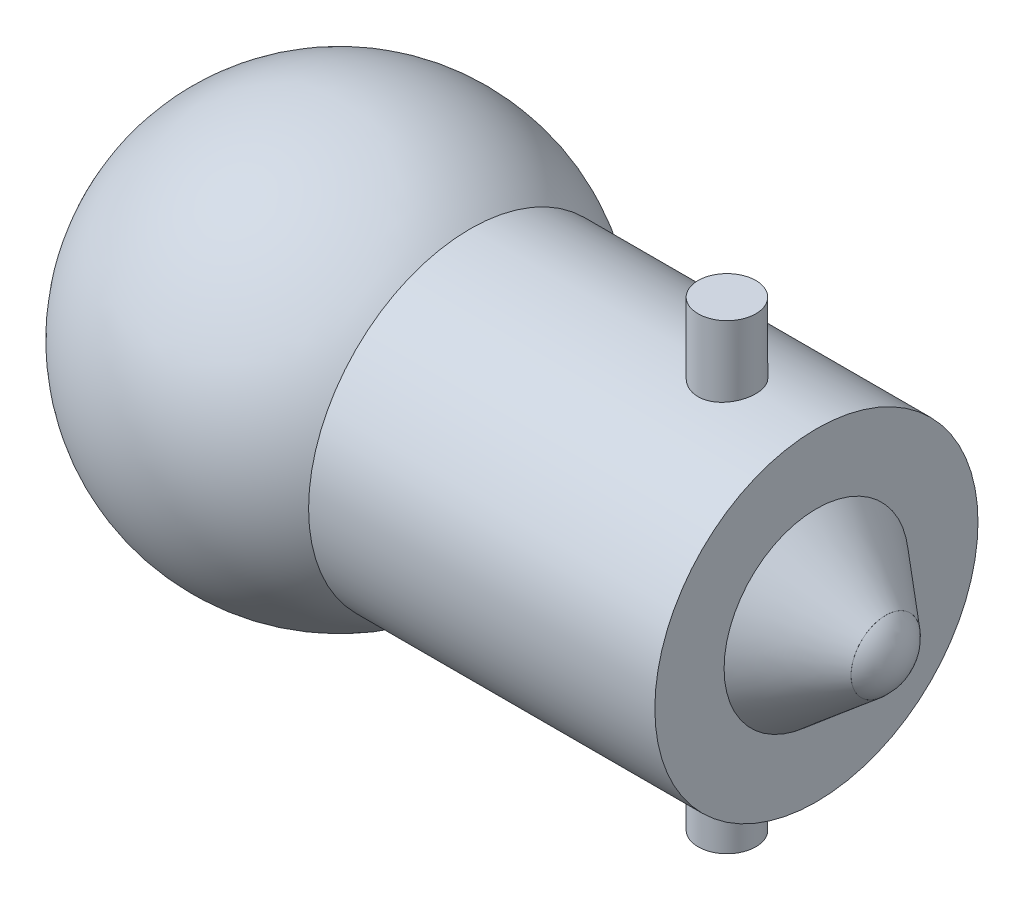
ISO-10303-21;
HEADER;
FILE_DESCRIPTION(('STEP AP214'),'2;1');
FILE_NAME('part.step','',(''),(''),'','','');
FILE_SCHEMA(('AUTOMOTIVE_DESIGN { 1 0 10303 214 1 1 1 1 }'));
ENDSEC;
DATA;
#1=APPLICATION_CONTEXT('core data for automotive mechanical design processes');
#2=APPLICATION_PROTOCOL_DEFINITION('international standard','automotive_design',2000,#1);
#3=PRODUCT_CONTEXT('',#1,'mechanical');
#4=PRODUCT('Part','Part','',(#3));
#5=PRODUCT_RELATED_PRODUCT_CATEGORY('part','',(#4));
#6=PRODUCT_DEFINITION_FORMATION('','',#4);
#7=PRODUCT_DEFINITION_CONTEXT('part definition',#1,'design');
#8=PRODUCT_DEFINITION('design','',#6,#7);
#9=PRODUCT_DEFINITION_SHAPE('','',#8);
#10=(LENGTH_UNIT() NAMED_UNIT(*) SI_UNIT(.MILLI.,.METRE.));
#11=(NAMED_UNIT(*) PLANE_ANGLE_UNIT() SI_UNIT($,.RADIAN.));
#12=(NAMED_UNIT(*) SI_UNIT($,.STERADIAN.) SOLID_ANGLE_UNIT());
#13=UNCERTAINTY_MEASURE_WITH_UNIT(LENGTH_MEASURE(1.E-05),#10,'distance_accuracy_value','');
#14=(GEOMETRIC_REPRESENTATION_CONTEXT(3) GLOBAL_UNCERTAINTY_ASSIGNED_CONTEXT((#13)) GLOBAL_UNIT_ASSIGNED_CONTEXT((#10,
#11,#12)) REPRESENTATION_CONTEXT('',''));
#15=CARTESIAN_POINT('',(0.,0.,0.));
#16=DIRECTION('',(0.,0.,1.));
#17=DIRECTION('',(1.,0.,0.));
#18=AXIS2_PLACEMENT_3D('',#15,#16,#17);
#19=CARTESIAN_POINT('',(-15.,0.,0.));
#20=DIRECTION('',(1.,0.,0.));
#21=DIRECTION('',(0.,0.,-1.));
#22=AXIS2_PLACEMENT_3D('',#19,#20,#21);
#23=CYLINDRICAL_SURFACE('',#22,7.);
#24=CARTESIAN_POINT('',(-3.875,-6.88748865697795,-1.25));
#25=CARTESIAN_POINT('',(-3.94460981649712,-6.88748996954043,-1.24999727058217));
#26=CARTESIAN_POINT('',(-4.01425577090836,-6.88855539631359,-1.24416565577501));
#27=CARTESIAN_POINT('',(-4.15158813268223,-6.89269731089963,-1.22100652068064));
#28=CARTESIAN_POINT('',(-4.21927275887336,-6.89577557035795,-1.20366887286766));
#29=CARTESIAN_POINT('',(-4.35067533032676,-6.90358364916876,-1.15804345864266));
#30=CARTESIAN_POINT('',(-4.41439674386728,-6.90831199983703,-1.12976542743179));
#31=CARTESIAN_POINT('',(-4.53618554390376,-6.91888575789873,-1.06308709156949));
#32=CARTESIAN_POINT('',(-4.59425345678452,-6.92473106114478,-1.024687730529));
#33=CARTESIAN_POINT('',(-4.70374846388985,-6.93695388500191,-0.938394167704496));
#34=CARTESIAN_POINT('',(-4.75510240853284,-6.94333619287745,-0.890407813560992));
#35=CARTESIAN_POINT('',(-4.84907526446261,-6.95587151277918,-0.786501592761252));
#36=CARTESIAN_POINT('',(-4.89169362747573,-6.96202451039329,-0.730581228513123));
#37=CARTESIAN_POINT('',(-4.96726335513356,-6.97345895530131,-0.611916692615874));
#38=CARTESIAN_POINT('',(-5.00014613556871,-6.97873410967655,-0.549128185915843));
#39=CARTESIAN_POINT('',(-5.05486987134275,-6.98776505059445,-0.41880838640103));
#40=CARTESIAN_POINT('',(-5.07671165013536,-6.99152095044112,-0.351277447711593));
#41=CARTESIAN_POINT('',(-5.10850824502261,-6.99705638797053,-0.214146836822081));
#42=CARTESIAN_POINT('',(-5.11858620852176,-6.99885638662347,-0.144576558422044));
#43=CARTESIAN_POINT('',(-5.12695246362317,-7.00034763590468,-0.00471086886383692));
#44=CARTESIAN_POINT('',(-5.12524166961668,-7.00003905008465,0.0655844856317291));
#45=CARTESIAN_POINT('',(-5.11017412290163,-6.99736398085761,0.204061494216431));
#46=CARTESIAN_POINT('',(-5.09694993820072,-6.99502092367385,0.272258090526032));
#47=CARTESIAN_POINT('',(-5.0594402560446,-6.98856637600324,0.405448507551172));
#48=CARTESIAN_POINT('',(-5.03515438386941,-6.98445482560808,0.470442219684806));
#49=CARTESIAN_POINT('',(-4.97608200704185,-6.97488577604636,0.59577075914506));
#50=CARTESIAN_POINT('',(-4.94124178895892,-6.96942141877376,0.656079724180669));
#51=CARTESIAN_POINT('',(-4.86208918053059,-6.95775231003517,0.770045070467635));
#52=CARTESIAN_POINT('',(-4.8177759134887,-6.95154749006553,0.823700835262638));
#53=CARTESIAN_POINT('',(-4.7202024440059,-6.93898404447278,0.923621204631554));
#54=CARTESIAN_POINT('',(-4.66682630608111,-6.93262448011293,0.969772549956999));
#55=CARTESIAN_POINT('',(-4.55303039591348,-6.92055128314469,1.05248393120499));
#56=CARTESIAN_POINT('',(-4.49261053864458,-6.9148376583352,1.08904385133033));
#57=CARTESIAN_POINT('',(-4.36630047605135,-6.9047022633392,1.15156239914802));
#58=CARTESIAN_POINT('',(-4.30040258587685,-6.90028234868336,1.17750582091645));
#59=CARTESIAN_POINT('',(-4.16508709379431,-6.89326416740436,1.21792201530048));
#60=CARTESIAN_POINT('',(-4.09566985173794,-6.89066571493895,1.23239595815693));
#61=CARTESIAN_POINT('',(-3.95630395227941,-6.88762108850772,1.24929958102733));
#62=CARTESIAN_POINT('',(-3.88637557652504,-6.88714593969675,1.25189141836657));
#63=CARTESIAN_POINT('',(-3.74708483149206,-6.88832434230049,1.24539080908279));
#64=CARTESIAN_POINT('',(-3.677722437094,-6.8899777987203,1.23629888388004));
#65=CARTESIAN_POINT('',(-3.54205770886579,-6.89520021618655,1.20682762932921));
#66=CARTESIAN_POINT('',(-3.47573654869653,-6.89875493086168,1.18653221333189));
#67=CARTESIAN_POINT('',(-3.34743634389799,-6.90736720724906,1.13531866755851));
#68=CARTESIAN_POINT('',(-3.28545759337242,-6.91242487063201,1.10439981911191));
#69=CARTESIAN_POINT('',(-3.16688393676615,-6.92353975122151,1.03243967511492));
#70=CARTESIAN_POINT('',(-3.11035254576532,-6.92960692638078,0.991295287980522));
#71=CARTESIAN_POINT('',(-3.00493787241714,-6.94202871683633,0.900192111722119));
#72=CARTESIAN_POINT('',(-2.95605521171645,-6.948383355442,0.850232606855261));
#73=CARTESIAN_POINT('',(-2.86672584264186,-6.96075653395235,0.742195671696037));
#74=CARTESIAN_POINT('',(-2.82638779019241,-6.96677010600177,0.684027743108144));
#75=CARTESIAN_POINT('',(-2.75605696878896,-6.97770176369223,0.561646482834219));
#76=CARTESIAN_POINT('',(-2.72606382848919,-6.98261988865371,0.497433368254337));
#77=CARTESIAN_POINT('',(-2.6774397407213,-6.99078504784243,0.365094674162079));
#78=CARTESIAN_POINT('',(-2.65875389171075,-6.99404014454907,0.296989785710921));
#79=CARTESIAN_POINT('',(-2.63309885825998,-6.99854674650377,0.158545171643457));
#80=CARTESIAN_POINT('',(-2.62612856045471,-6.9997984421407,0.0882056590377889));
#81=CARTESIAN_POINT('',(-2.62413828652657,-7.00015390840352,-0.0516665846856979));
#82=CARTESIAN_POINT('',(-2.62895367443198,-6.99928727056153,-0.121196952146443));
#83=CARTESIAN_POINT('',(-2.65003948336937,-6.99556445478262,-0.258441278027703));
#84=CARTESIAN_POINT('',(-2.66630981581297,-6.99270829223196,-0.326155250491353));
#85=CARTESIAN_POINT('',(-2.70977696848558,-6.98532676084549,-0.457768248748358));
#86=CARTESIAN_POINT('',(-2.73695781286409,-6.98080383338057,-0.521672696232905));
#87=CARTESIAN_POINT('',(-2.80145534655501,-6.97058019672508,-0.644038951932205));
#88=CARTESIAN_POINT('',(-2.83877262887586,-6.96487941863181,-0.702500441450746));
#89=CARTESIAN_POINT('',(-2.92305799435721,-6.952836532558,-0.813145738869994));
#90=CARTESIAN_POINT('',(-2.97014575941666,-6.94648702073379,-0.865237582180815));
#91=CARTESIAN_POINT('',(-3.07238568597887,-6.9339109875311,-0.960837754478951));
#92=CARTESIAN_POINT('',(-3.12753973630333,-6.92768449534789,-1.0043440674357));
#93=CARTESIAN_POINT('',(-3.24489058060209,-6.91600352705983,-1.08187311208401));
#94=CARTESIAN_POINT('',(-3.30714182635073,-6.9105558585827,-1.1158144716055));
#95=CARTESIAN_POINT('',(-3.43653753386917,-6.90113054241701,-1.17270443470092));
#96=CARTESIAN_POINT('',(-3.50367718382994,-6.89715147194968,-1.19566368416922));
#97=CARTESIAN_POINT('',(-3.62170336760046,-6.89196709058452,-1.22512899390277));
#98=CARTESIAN_POINT('',(-3.67188793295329,-6.89029736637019,-1.23444009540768));
#99=CARTESIAN_POINT('',(-3.77304188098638,-6.88805768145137,-1.24687652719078));
#100=CARTESIAN_POINT('',(-3.82401124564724,-6.88748769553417,-1.25000199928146));
#101=CARTESIAN_POINT('',(-3.875,-6.88748865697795,-1.25));
#102=B_SPLINE_CURVE_WITH_KNOTS('',3,(#24,#25,#26,#27,#28,#29,#30,#31,#32,#33,#34,#35,#36,#37,
#38,#39,#40,#41,#42,#43,#44,#45,#46,#47,#48,#49,#50,#51,#52,#53,#54,#55,#56,#57,#58,#59,#60,#61,
#62,#63,#64,#65,#66,#67,#68,#69,#70,#71,#72,#73,#74,#75,#76,#77,#78,#79,#80,#81,#82,#83,#84,#85,
#86,#87,#88,#89,#90,#91,#92,#93,#94,#95,#96,#97,#98,#99,#100,#101),.UNSPECIFIED.,.T.,.F.,(4,2,2,
2,2,2,2,2,2,2,2,2,2,2,2,2,2,2,2,2,2,2,2,2,2,2,2,2,2,2,2,2,2,2,2,2,2,2,4),(0.,0.208642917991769,
0.417469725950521,0.626111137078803,0.834733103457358,1.04546625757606,1.25621263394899,
1.46841013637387,1.68059181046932,1.89053179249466,2.10045549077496,2.30799357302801,
2.51553868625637,2.72415831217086,2.93279725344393,3.14433992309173,3.35588514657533,
3.56773231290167,3.77955786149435,3.98848380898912,4.19740043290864,4.40477310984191,
4.61215981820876,4.82172878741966,5.03131478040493,5.24342420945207,5.45552602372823,
5.66658955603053,5.87763302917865,6.08574527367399,6.29385590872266,6.50166292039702,
6.70948209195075,6.9200155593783,7.1305984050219,7.34292209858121,7.55503954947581,
7.70787268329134,7.86070231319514),.UNSPECIFIED.);
#103=CARTESIAN_POINT('',(-3.875,-6.88748865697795,-1.25));
#104=VERTEX_POINT('',#103);
#105=EDGE_CURVE('E62',#104,#104,#102,.T.);
#106=ORIENTED_EDGE('',*,*,#105,.T.);
#107=EDGE_LOOP('',(#106));
#108=FACE_BOUND('',#107,.T.);
#109=CARTESIAN_POINT('',(-15.,0.,0.));
#110=DIRECTION('',(1.,0.,0.));
#111=DIRECTION('',(0.,0.,-1.));
#112=AXIS2_PLACEMENT_3D('',#109,#110,#111);
#113=CIRCLE('',#112,7.);
#114=CARTESIAN_POINT('',(-15.,0.,-7.));
#115=VERTEX_POINT('',#114);
#116=EDGE_CURVE('E104',#115,#115,#113,.T.);
#117=ORIENTED_EDGE('',*,*,#116,.T.);
#118=EDGE_LOOP('',(#117));
#119=FACE_BOUND('',#118,.T.);
#120=CARTESIAN_POINT('',(0.,0.,0.));
#121=DIRECTION('',(1.,0.,0.));
#122=DIRECTION('',(0.,0.,-1.));
#123=AXIS2_PLACEMENT_3D('',#120,#121,#122);
#124=CIRCLE('',#123,7.);
#125=CARTESIAN_POINT('',(0.,0.,-7.));
#126=VERTEX_POINT('',#125);
#127=EDGE_CURVE('E59',#126,#126,#124,.T.);
#128=ORIENTED_EDGE('',*,*,#127,.F.);
#129=EDGE_LOOP('',(#128));
#130=FACE_BOUND('',#129,.T.);
#131=CARTESIAN_POINT('',(-3.875,6.88748865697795,-1.25));
#132=CARTESIAN_POINT('',(-3.80539018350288,6.88748996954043,-1.24999727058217));
#133=CARTESIAN_POINT('',(-3.73574422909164,6.88855539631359,-1.24416565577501));
#134=CARTESIAN_POINT('',(-3.59841186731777,6.89269731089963,-1.22100652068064));
#135=CARTESIAN_POINT('',(-3.53072724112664,6.89577557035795,-1.20366887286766));
#136=CARTESIAN_POINT('',(-3.39932466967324,6.90358364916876,-1.15804345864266));
#137=CARTESIAN_POINT('',(-3.33560325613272,6.90831199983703,-1.12976542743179));
#138=CARTESIAN_POINT('',(-3.21381445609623,6.91888575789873,-1.06308709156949));
#139=CARTESIAN_POINT('',(-3.15574654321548,6.92473106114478,-1.024687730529));
#140=CARTESIAN_POINT('',(-3.04625153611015,6.93695388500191,-0.938394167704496));
#141=CARTESIAN_POINT('',(-2.99489759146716,6.94333619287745,-0.890407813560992));
#142=CARTESIAN_POINT('',(-2.90092473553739,6.95587151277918,-0.786501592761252));
#143=CARTESIAN_POINT('',(-2.85830637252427,6.96202451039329,-0.730581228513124));
#144=CARTESIAN_POINT('',(-2.78273664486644,6.97345895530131,-0.611916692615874));
#145=CARTESIAN_POINT('',(-2.74985386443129,6.97873410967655,-0.549128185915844));
#146=CARTESIAN_POINT('',(-2.69513012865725,6.98776505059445,-0.418808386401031));
#147=CARTESIAN_POINT('',(-2.67328834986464,6.99152095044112,-0.351277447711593));
#148=CARTESIAN_POINT('',(-2.64149175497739,6.99705638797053,-0.214146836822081));
#149=CARTESIAN_POINT('',(-2.63141379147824,6.99885638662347,-0.144576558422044));
#150=CARTESIAN_POINT('',(-2.62304753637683,7.00034763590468,-0.00471086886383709));
#151=CARTESIAN_POINT('',(-2.62475833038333,7.00003905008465,0.0655844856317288));
#152=CARTESIAN_POINT('',(-2.63982587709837,6.99736398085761,0.20406149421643));
#153=CARTESIAN_POINT('',(-2.65305006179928,6.99502092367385,0.272258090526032));
#154=CARTESIAN_POINT('',(-2.6905597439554,6.98856637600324,0.405448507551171));
#155=CARTESIAN_POINT('',(-2.71484561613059,6.98445482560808,0.470442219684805));
#156=CARTESIAN_POINT('',(-2.77391799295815,6.97488577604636,0.59577075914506));
#157=CARTESIAN_POINT('',(-2.80875821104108,6.96942141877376,0.656079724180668));
#158=CARTESIAN_POINT('',(-2.88791081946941,6.95775231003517,0.770045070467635));
#159=CARTESIAN_POINT('',(-2.9322240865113,6.95154749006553,0.823700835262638));
#160=CARTESIAN_POINT('',(-3.0297975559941,6.93898404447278,0.923621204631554));
#161=CARTESIAN_POINT('',(-3.08317369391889,6.93262448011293,0.969772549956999));
#162=CARTESIAN_POINT('',(-3.19696960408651,6.92055128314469,1.05248393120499));
#163=CARTESIAN_POINT('',(-3.25738946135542,6.9148376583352,1.08904385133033));
#164=CARTESIAN_POINT('',(-3.38369952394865,6.9047022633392,1.15156239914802));
#165=CARTESIAN_POINT('',(-3.44959741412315,6.90028234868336,1.17750582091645));
#166=CARTESIAN_POINT('',(-3.58491290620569,6.89326416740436,1.21792201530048));
#167=CARTESIAN_POINT('',(-3.65433014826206,6.89066571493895,1.23239595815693));
#168=CARTESIAN_POINT('',(-3.79369604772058,6.88762108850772,1.24929958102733));
#169=CARTESIAN_POINT('',(-3.86362442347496,6.88714593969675,1.25189141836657));
#170=CARTESIAN_POINT('',(-4.00291516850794,6.88832434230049,1.24539080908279));
#171=CARTESIAN_POINT('',(-4.072277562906,6.8899777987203,1.23629888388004));
#172=CARTESIAN_POINT('',(-4.20794229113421,6.89520021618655,1.20682762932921));
#173=CARTESIAN_POINT('',(-4.27426345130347,6.89875493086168,1.18653221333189));
#174=CARTESIAN_POINT('',(-4.40256365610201,6.90736720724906,1.13531866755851));
#175=CARTESIAN_POINT('',(-4.46454240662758,6.91242487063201,1.10439981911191));
#176=CARTESIAN_POINT('',(-4.58311606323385,6.92353975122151,1.03243967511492));
#177=CARTESIAN_POINT('',(-4.63964745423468,6.92960692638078,0.991295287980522));
#178=CARTESIAN_POINT('',(-4.74506212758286,6.94202871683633,0.90019211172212));
#179=CARTESIAN_POINT('',(-4.79394478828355,6.948383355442,0.850232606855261));
#180=CARTESIAN_POINT('',(-4.88327415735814,6.96075653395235,0.742195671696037));
#181=CARTESIAN_POINT('',(-4.92361220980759,6.96677010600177,0.684027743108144));
#182=CARTESIAN_POINT('',(-4.99394303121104,6.97770176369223,0.561646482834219));
#183=CARTESIAN_POINT('',(-5.02393617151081,6.98261988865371,0.497433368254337));
#184=CARTESIAN_POINT('',(-5.0725602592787,6.99078504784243,0.365094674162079));
#185=CARTESIAN_POINT('',(-5.09124610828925,6.99404014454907,0.296989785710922));
#186=CARTESIAN_POINT('',(-5.11690114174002,6.99854674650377,0.158545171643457));
#187=CARTESIAN_POINT('',(-5.12387143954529,6.9997984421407,0.0882056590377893));
#188=CARTESIAN_POINT('',(-5.12586171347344,7.00015390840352,-0.0516665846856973));
#189=CARTESIAN_POINT('',(-5.12104632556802,6.99928727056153,-0.121196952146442));
#190=CARTESIAN_POINT('',(-5.09996051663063,6.99556445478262,-0.258441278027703));
#191=CARTESIAN_POINT('',(-5.08369018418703,6.99270829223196,-0.326155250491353));
#192=CARTESIAN_POINT('',(-5.04022303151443,6.98532676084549,-0.457768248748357));
#193=CARTESIAN_POINT('',(-5.01304218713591,6.98080383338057,-0.521672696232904));
#194=CARTESIAN_POINT('',(-4.94854465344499,6.97058019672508,-0.644038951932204));
#195=CARTESIAN_POINT('',(-4.91122737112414,6.96487941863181,-0.702500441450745));
#196=CARTESIAN_POINT('',(-4.82694200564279,6.952836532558,-0.813145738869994));
#197=CARTESIAN_POINT('',(-4.77985424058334,6.94648702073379,-0.865237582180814));
#198=CARTESIAN_POINT('',(-4.67761431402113,6.9339109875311,-0.960837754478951));
#199=CARTESIAN_POINT('',(-4.62246026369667,6.92768449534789,-1.0043440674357));
#200=CARTESIAN_POINT('',(-4.50510941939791,6.91600352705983,-1.08187311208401));
#201=CARTESIAN_POINT('',(-4.44285817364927,6.9105558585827,-1.1158144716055));
#202=CARTESIAN_POINT('',(-4.31346246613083,6.90113054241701,-1.17270443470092));
#203=CARTESIAN_POINT('',(-4.24632281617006,6.89715147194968,-1.19566368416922));
#204=CARTESIAN_POINT('',(-4.12829663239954,6.89196709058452,-1.22512899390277));
#205=CARTESIAN_POINT('',(-4.07811206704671,6.89029736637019,-1.23444009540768));
#206=CARTESIAN_POINT('',(-3.97695811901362,6.88805768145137,-1.24687652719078));
#207=CARTESIAN_POINT('',(-3.92598875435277,6.88748769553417,-1.25000199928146));
#208=CARTESIAN_POINT('',(-3.875,6.88748865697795,-1.25));
#209=B_SPLINE_CURVE_WITH_KNOTS('',3,(#131,#132,#133,#134,#135,#136,#137,#138,#139,#140,#141,
#142,#143,#144,#145,#146,#147,#148,#149,#150,#151,#152,#153,#154,#155,#156,#157,#158,#159,#160,
#161,#162,#163,#164,#165,#166,#167,#168,#169,#170,#171,#172,#173,#174,#175,#176,#177,#178,#179,
#180,#181,#182,#183,#184,#185,#186,#187,#188,#189,#190,#191,#192,#193,#194,#195,#196,#197,#198,
#199,#200,#201,#202,#203,#204,#205,#206,#207,#208),.UNSPECIFIED.,.T.,.F.,(4,2,2,2,2,2,2,2,2,2,2,
2,2,2,2,2,2,2,2,2,2,2,2,2,2,2,2,2,2,2,2,2,2,2,2,2,2,2,4),(0.,0.208642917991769,
0.417469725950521,0.626111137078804,0.834733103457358,1.04546625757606,1.25621263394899,
1.46841013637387,1.68059181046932,1.89053179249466,2.10045549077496,2.30799357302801,
2.51553868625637,2.72415831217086,2.93279725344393,3.14433992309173,3.35588514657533,
3.56773231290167,3.77955786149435,3.98848380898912,4.19740043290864,4.40477310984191,
4.61215981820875,4.82172878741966,5.03131478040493,5.24342420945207,5.45552602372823,
5.66658955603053,5.87763302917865,6.08574527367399,6.29385590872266,6.50166292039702,
6.70948209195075,6.9200155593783,7.1305984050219,7.34292209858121,7.55503954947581,
7.70787268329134,7.86070231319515),.UNSPECIFIED.);
#210=CARTESIAN_POINT('',(-3.875,6.88748865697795,-1.25));
#211=VERTEX_POINT('',#210);
#212=EDGE_CURVE('E47',#211,#211,#209,.T.);
#213=ORIENTED_EDGE('',*,*,#212,.T.);
#214=EDGE_LOOP('',(#213));
#215=FACE_BOUND('',#214,.T.);
#216=ADVANCED_FACE('F43',(#108,#119,#130,#215),#23,.T.);
#217=CARTESIAN_POINT('',(0.,0.,0.));
#218=DIRECTION('',(1.,0.,0.));
#219=DIRECTION('',(0.,0.,-1.));
#220=AXIS2_PLACEMENT_3D('',#217,#218,#219);
#221=PLANE('',#220);
#222=CARTESIAN_POINT('',(0.,0.,0.));
#223=DIRECTION('',(1.,0.,0.));
#224=DIRECTION('',(0.,0.,-1.));
#225=AXIS2_PLACEMENT_3D('',#222,#223,#224);
#226=CIRCLE('',#225,4.);
#227=CARTESIAN_POINT('',(0.,0.,-4.));
#228=VERTEX_POINT('',#227);
#229=EDGE_CURVE('E54',#228,#228,#226,.T.);
#230=ORIENTED_EDGE('',*,*,#229,.F.);
#231=EDGE_LOOP('',(#230));
#232=FACE_BOUND('',#231,.T.);
#233=ORIENTED_EDGE('',*,*,#127,.T.);
#234=EDGE_LOOP('',(#233));
#235=FACE_BOUND('',#234,.T.);
#236=ADVANCED_FACE('F91',(#232,#235),#221,.T.);
#237=CARTESIAN_POINT('',(-20.6568542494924,0.,0.));
#238=DIRECTION('',(-1.,0.,0.));
#239=DIRECTION('',(0.,1.,0.));
#240=AXIS2_PLACEMENT_3D('',#237,#238,#239);
#241=SPHERICAL_SURFACE('',#240,9.);
#242=ORIENTED_EDGE('',*,*,#116,.F.);
#243=EDGE_LOOP('',(#242));
#244=FACE_BOUND('',#243,.T.);
#245=ADVANCED_FACE('F88',(#244),#241,.T.);
#246=CARTESIAN_POINT('',(0.,0.,0.));
#247=DIRECTION('',(-1.,0.,0.));
#248=DIRECTION('',(0.,0.,1.));
#249=AXIS2_PLACEMENT_3D('',#246,#247,#248);
#250=CONICAL_SURFACE('',#249,4.,0.694738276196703);
#251=CARTESIAN_POINT('',(3.,0.,0.));
#252=DIRECTION('',(-1.,0.,0.));
#253=DIRECTION('',(0.,0.,1.));
#254=AXIS2_PLACEMENT_3D('',#251,#252,#253);
#255=CIRCLE('',#254,1.5);
#256=CARTESIAN_POINT('',(3.,0.,1.5));
#257=VERTEX_POINT('',#256);
#258=EDGE_CURVE('E106',#257,#257,#255,.T.);
#259=ORIENTED_EDGE('',*,*,#258,.T.);
#260=EDGE_LOOP('',(#259));
#261=FACE_BOUND('',#260,.T.);
#262=ORIENTED_EDGE('',*,*,#229,.T.);
#263=EDGE_LOOP('',(#262));
#264=FACE_BOUND('',#263,.T.);
#265=ADVANCED_FACE('F84',(#261,#264),#250,.T.);
#266=CARTESIAN_POINT('',(3.,-1.5,0.));
#267=DIRECTION('',(1.,0.,0.));
#268=DIRECTION('',(0.,0.,-1.));
#269=AXIS2_PLACEMENT_3D('',#266,#267,#268);
#270=PLANE('',#269);
#271=CARTESIAN_POINT('',(3.,0.,0.));
#272=DIRECTION('',(1.,0.,0.));
#273=DIRECTION('',(0.,0.,-1.));
#274=AXIS2_PLACEMENT_3D('',#271,#272,#273);
#275=CIRCLE('',#274,1.49891945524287);
#276=CARTESIAN_POINT('',(3.,0.,-1.49891945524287));
#277=VERTEX_POINT('',#276);
#278=EDGE_CURVE('E12',#277,#277,#275,.T.);
#279=ORIENTED_EDGE('',*,*,#278,.F.);
#280=EDGE_LOOP('',(#279));
#281=FACE_BOUND('',#280,.T.);
#282=ORIENTED_EDGE('',*,*,#258,.F.);
#283=EDGE_LOOP('',(#282));
#284=FACE_BOUND('',#283,.T.);
#285=ADVANCED_FACE('F81',(#281,#284),#270,.T.);
#286=CARTESIAN_POINT('',(1.67590012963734,0.,0.));
#287=DIRECTION('',(-1.,0.,0.));
#288=DIRECTION('',(0.,1.,0.));
#289=AXIS2_PLACEMENT_3D('',#286,#287,#288);
#290=SPHERICAL_SURFACE('',#289,2.);
#291=ORIENTED_EDGE('',*,*,#278,.T.);
#292=EDGE_LOOP('',(#291));
#293=FACE_BOUND('',#292,.T.);
#294=ADVANCED_FACE('F77',(#293),#290,.T.);
#295=CARTESIAN_POINT('',(-3.875,-10.,0.));
#296=DIRECTION('',(0.,1.,0.));
#297=DIRECTION('',(0.,0.,1.));
#298=AXIS2_PLACEMENT_3D('',#295,#296,#297);
#299=PLANE('',#298);
#300=CARTESIAN_POINT('',(-3.875,-10.,0.));
#301=DIRECTION('',(0.,1.,0.));
#302=DIRECTION('',(0.,0.,1.));
#303=AXIS2_PLACEMENT_3D('',#300,#301,#302);
#304=CIRCLE('',#303,1.25);
#305=CARTESIAN_POINT('',(-3.875,-10.,1.25));
#306=VERTEX_POINT('',#305);
#307=EDGE_CURVE('E113',#306,#306,#304,.T.);
#308=ORIENTED_EDGE('',*,*,#307,.F.);
#309=EDGE_LOOP('',(#308));
#310=FACE_BOUND('',#309,.T.);
#311=ADVANCED_FACE('F73',(#310),#299,.F.);
#312=CARTESIAN_POINT('',(-3.875,10.,0.));
#313=DIRECTION('',(0.,-1.,0.));
#314=DIRECTION('',(0.,0.,-1.));
#315=AXIS2_PLACEMENT_3D('',#312,#313,#314);
#316=CYLINDRICAL_SURFACE('',#315,1.25);
#317=ORIENTED_EDGE('',*,*,#105,.F.);
#318=EDGE_LOOP('',(#317));
#319=FACE_BOUND('',#318,.T.);
#320=ORIENTED_EDGE('',*,*,#307,.T.);
#321=EDGE_LOOP('',(#320));
#322=FACE_BOUND('',#321,.T.);
#323=ADVANCED_FACE('F67',(#319,#322),#316,.T.);
#324=ORIENTED_EDGE('',*,*,#212,.F.);
#325=EDGE_LOOP('',(#324));
#326=FACE_BOUND('',#325,.T.);
#327=CARTESIAN_POINT('',(-3.875,10.,0.));
#328=DIRECTION('',(0.,1.,0.));
#329=DIRECTION('',(0.,0.,1.));
#330=AXIS2_PLACEMENT_3D('',#327,#328,#329);
#331=CIRCLE('',#330,1.25);
#332=CARTESIAN_POINT('',(-3.875,10.,1.25));
#333=VERTEX_POINT('',#332);
#334=EDGE_CURVE('E66',#333,#333,#331,.T.);
#335=ORIENTED_EDGE('',*,*,#334,.F.);
#336=EDGE_LOOP('',(#335));
#337=FACE_BOUND('',#336,.T.);
#338=ADVANCED_FACE('F72',(#326,#337),#316,.T.);
#339=CARTESIAN_POINT('',(-3.875,10.,0.));
#340=DIRECTION('',(0.,1.,0.));
#341=DIRECTION('',(0.,0.,1.));
#342=AXIS2_PLACEMENT_3D('',#339,#340,#341);
#343=PLANE('',#342);
#344=ORIENTED_EDGE('',*,*,#334,.T.);
#345=EDGE_LOOP('',(#344));
#346=FACE_BOUND('',#345,.T.);
#347=ADVANCED_FACE('F75',(#346),#343,.T.);
#348=CLOSED_SHELL('',(#216,#236,#245,#265,#285,#294,#311,#323,#338,#347));
#349=MANIFOLD_SOLID_BREP('B2',#348);
#350=ADVANCED_BREP_SHAPE_REPRESENTATION('',(#18,#349),#14);
#351=SHAPE_DEFINITION_REPRESENTATION(#9,#350);
ENDSEC;
END-ISO-10303-21;
